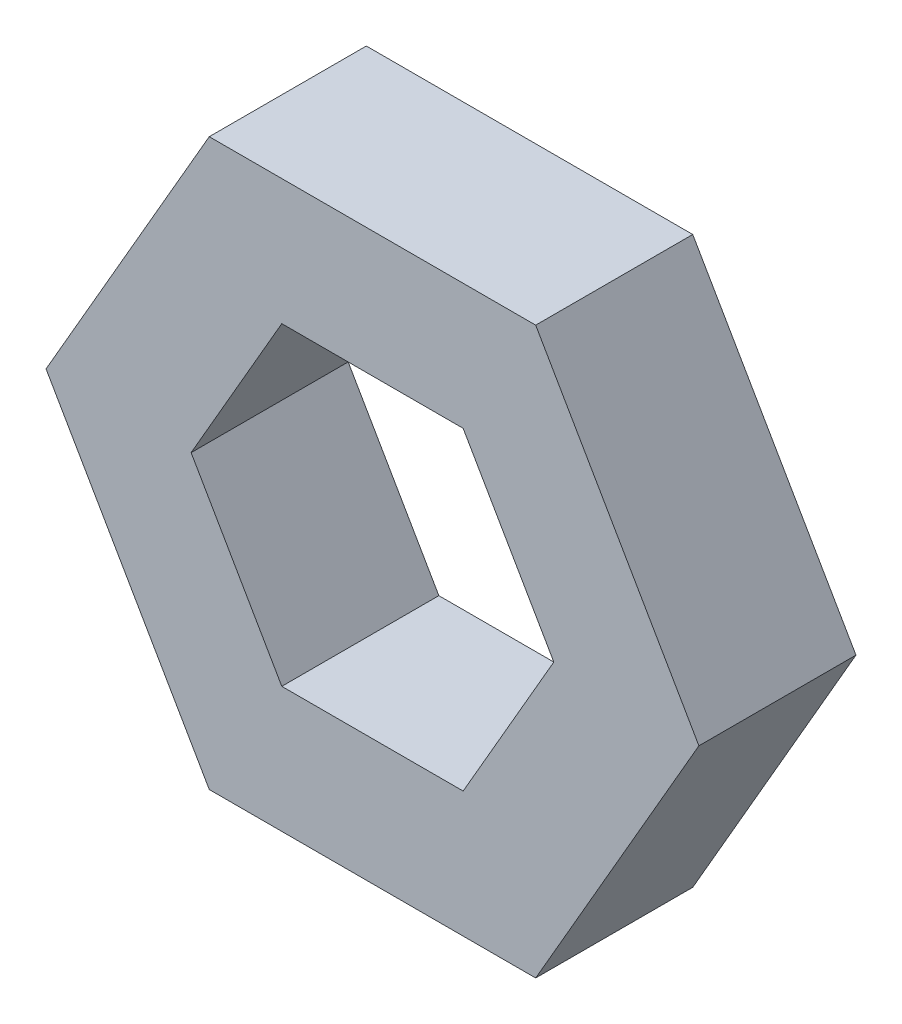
ISO-10303-21;
HEADER;
FILE_DESCRIPTION(('STEP AP214'),'2;1');
FILE_NAME('part.step','',(''),(''),'','','');
FILE_SCHEMA(('AUTOMOTIVE_DESIGN { 1 0 10303 214 1 1 1 1 }'));
ENDSEC;
DATA;
#1=APPLICATION_CONTEXT('core data for automotive mechanical design processes');
#2=APPLICATION_PROTOCOL_DEFINITION('international standard','automotive_design',2000,#1);
#3=PRODUCT_CONTEXT('',#1,'mechanical');
#4=PRODUCT('Part','Part','',(#3));
#5=PRODUCT_RELATED_PRODUCT_CATEGORY('part','',(#4));
#6=PRODUCT_DEFINITION_FORMATION('','',#4);
#7=PRODUCT_DEFINITION_CONTEXT('part definition',#1,'design');
#8=PRODUCT_DEFINITION('design','',#6,#7);
#9=PRODUCT_DEFINITION_SHAPE('','',#8);
#10=(LENGTH_UNIT() NAMED_UNIT(*) SI_UNIT(.MILLI.,.METRE.));
#11=(NAMED_UNIT(*) PLANE_ANGLE_UNIT() SI_UNIT($,.RADIAN.));
#12=(NAMED_UNIT(*) SI_UNIT($,.STERADIAN.) SOLID_ANGLE_UNIT());
#13=UNCERTAINTY_MEASURE_WITH_UNIT(LENGTH_MEASURE(1.E-05),#10,'distance_accuracy_value','');
#14=(GEOMETRIC_REPRESENTATION_CONTEXT(3) GLOBAL_UNCERTAINTY_ASSIGNED_CONTEXT((#13)) GLOBAL_UNIT_ASSIGNED_CONTEXT((#10,
#11,#12)) REPRESENTATION_CONTEXT('',''));
#15=CARTESIAN_POINT('',(0.,0.,0.));
#16=DIRECTION('',(0.,0.,1.));
#17=DIRECTION('',(1.,0.,0.));
#18=AXIS2_PLACEMENT_3D('',#15,#16,#17);
#19=CARTESIAN_POINT('',(0.,0.,3.175));
#20=DIRECTION('',(0.,0.,1.));
#21=DIRECTION('',(1.,0.,0.));
#22=AXIS2_PLACEMENT_3D('',#19,#20,#21);
#23=PLANE('',#22);
#24=DIRECTION('',(0.5,0.866025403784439,0.));
#25=VECTOR('',#24,1.);
#26=CARTESIAN_POINT('',(3.29955678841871,-5.715,3.175));
#27=LINE('',#26,#25);
#28=CARTESIAN_POINT('',(3.29955678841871,-5.715,3.175));
#29=VERTEX_POINT('',#28);
#30=CARTESIAN_POINT('',(6.59911357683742,0.,3.175));
#31=VERTEX_POINT('',#30);
#32=EDGE_CURVE('E175',#29,#31,#27,.T.);
#33=ORIENTED_EDGE('',*,*,#32,.T.);
#34=DIRECTION('',(-0.5,0.866025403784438,0.));
#35=VECTOR('',#34,1.);
#36=CARTESIAN_POINT('',(6.59911357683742,0.,3.175));
#37=LINE('',#36,#35);
#38=CARTESIAN_POINT('',(3.29955678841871,5.715,3.175));
#39=VERTEX_POINT('',#38);
#40=EDGE_CURVE('E178',#31,#39,#37,.T.);
#41=ORIENTED_EDGE('',*,*,#40,.T.);
#42=DIRECTION('',(-1.,0.,0.));
#43=VECTOR('',#42,1.);
#44=CARTESIAN_POINT('',(3.29955678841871,5.715,3.175));
#45=LINE('',#44,#43);
#46=CARTESIAN_POINT('',(-3.29955678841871,5.715,3.175));
#47=VERTEX_POINT('',#46);
#48=EDGE_CURVE('E181',#39,#47,#45,.T.);
#49=ORIENTED_EDGE('',*,*,#48,.T.);
#50=DIRECTION('',(-0.5,-0.866025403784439,0.));
#51=VECTOR('',#50,1.);
#52=CARTESIAN_POINT('',(-3.29955678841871,5.715,3.175));
#53=LINE('',#52,#51);
#54=CARTESIAN_POINT('',(-6.59911357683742,0.,3.175));
#55=VERTEX_POINT('',#54);
#56=EDGE_CURVE('E183',#47,#55,#53,.T.);
#57=ORIENTED_EDGE('',*,*,#56,.T.);
#58=DIRECTION('',(0.5,-0.866025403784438,0.));
#59=VECTOR('',#58,1.);
#60=CARTESIAN_POINT('',(-6.59911357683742,0.,3.175));
#61=LINE('',#60,#59);
#62=CARTESIAN_POINT('',(-3.29955678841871,-5.715,3.175));
#63=VERTEX_POINT('',#62);
#64=EDGE_CURVE('E185',#55,#63,#61,.T.);
#65=ORIENTED_EDGE('',*,*,#64,.T.);
#66=DIRECTION('',(1.,0.,0.));
#67=VECTOR('',#66,1.);
#68=CARTESIAN_POINT('',(-3.29955678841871,-5.715,3.175));
#69=LINE('',#68,#67);
#70=EDGE_CURVE('E187',#63,#29,#69,.T.);
#71=ORIENTED_EDGE('',*,*,#70,.T.);
#72=EDGE_LOOP('',(#33,#41,#49,#57,#65,#71));
#73=FACE_BOUND('',#72,.T.);
#74=DIRECTION('',(-0.500000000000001,0.866025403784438,0.));
#75=VECTOR('',#74,1.);
#76=CARTESIAN_POINT('',(3.66617420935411,0.,3.175));
#77=LINE('',#76,#75);
#78=CARTESIAN_POINT('',(3.66617420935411,0.,3.175));
#79=VERTEX_POINT('',#78);
#80=CARTESIAN_POINT('',(1.83308710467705,3.17499999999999,3.175));
#81=VERTEX_POINT('',#80);
#82=EDGE_CURVE('E132',#79,#81,#77,.T.);
#83=ORIENTED_EDGE('',*,*,#82,.F.);
#84=DIRECTION('',(0.499999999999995,0.866025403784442,0.));
#85=VECTOR('',#84,1.);
#86=CARTESIAN_POINT('',(1.83308710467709,-3.17499999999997,3.175));
#87=LINE('',#86,#85);
#88=CARTESIAN_POINT('',(1.83308710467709,-3.17499999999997,3.175));
#89=VERTEX_POINT('',#88);
#90=EDGE_CURVE('E124',#89,#79,#87,.T.);
#91=ORIENTED_EDGE('',*,*,#90,.F.);
#92=DIRECTION('',(1.,0.,0.));
#93=VECTOR('',#92,1.);
#94=CARTESIAN_POINT('',(-1.83308710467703,-3.17500000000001,3.175));
#95=LINE('',#94,#93);
#96=CARTESIAN_POINT('',(-1.83308710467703,-3.17500000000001,3.175));
#97=VERTEX_POINT('',#96);
#98=EDGE_CURVE('E153',#97,#89,#95,.T.);
#99=ORIENTED_EDGE('',*,*,#98,.F.);
#100=DIRECTION('',(0.500000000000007,-0.866025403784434,0.));
#101=VECTOR('',#100,1.);
#102=CARTESIAN_POINT('',(-3.66617420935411,0.,3.175));
#103=LINE('',#102,#101);
#104=CARTESIAN_POINT('',(-3.66617420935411,0.,3.175));
#105=VERTEX_POINT('',#104);
#106=EDGE_CURVE('E151',#105,#97,#103,.T.);
#107=ORIENTED_EDGE('',*,*,#106,.F.);
#108=DIRECTION('',(-0.499999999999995,-0.866025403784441,0.));
#109=VECTOR('',#108,1.);
#110=CARTESIAN_POINT('',(-1.83308710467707,3.17499999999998,3.175));
#111=LINE('',#110,#109);
#112=CARTESIAN_POINT('',(-1.83308710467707,3.17499999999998,3.175));
#113=VERTEX_POINT('',#112);
#114=EDGE_CURVE('E147',#113,#105,#111,.T.);
#115=ORIENTED_EDGE('',*,*,#114,.F.);
#116=DIRECTION('',(-1.,0.,0.));
#117=VECTOR('',#116,1.);
#118=CARTESIAN_POINT('',(1.83308710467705,3.17499999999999,3.175));
#119=LINE('',#118,#117);
#120=EDGE_CURVE('E145',#81,#113,#119,.T.);
#121=ORIENTED_EDGE('',*,*,#120,.F.);
#122=EDGE_LOOP('',(#83,#91,#99,#107,#115,#121));
#123=FACE_BOUND('',#122,.T.);
#124=ADVANCED_FACE('F35',(#73,#123),#23,.T.);
#125=CARTESIAN_POINT('',(0.,0.,0.));
#126=DIRECTION('',(0.,0.,1.));
#127=DIRECTION('',(1.,0.,0.));
#128=AXIS2_PLACEMENT_3D('',#125,#126,#127);
#129=PLANE('',#128);
#130=DIRECTION('',(0.5,0.866025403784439,0.));
#131=VECTOR('',#130,1.);
#132=CARTESIAN_POINT('',(3.29955678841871,-5.715,0.));
#133=LINE('',#132,#131);
#134=CARTESIAN_POINT('',(3.29955678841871,-5.715,0.));
#135=VERTEX_POINT('',#134);
#136=CARTESIAN_POINT('',(6.59911357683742,0.,0.));
#137=VERTEX_POINT('',#136);
#138=EDGE_CURVE('E140',#135,#137,#133,.T.);
#139=ORIENTED_EDGE('',*,*,#138,.F.);
#140=DIRECTION('',(1.,0.,0.));
#141=VECTOR('',#140,1.);
#142=CARTESIAN_POINT('',(-3.29955678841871,-5.715,0.));
#143=LINE('',#142,#141);
#144=CARTESIAN_POINT('',(-3.29955678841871,-5.715,0.));
#145=VERTEX_POINT('',#144);
#146=EDGE_CURVE('E179',#145,#135,#143,.T.);
#147=ORIENTED_EDGE('',*,*,#146,.F.);
#148=DIRECTION('',(0.5,-0.866025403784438,0.));
#149=VECTOR('',#148,1.);
#150=CARTESIAN_POINT('',(-6.59911357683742,0.,0.));
#151=LINE('',#150,#149);
#152=CARTESIAN_POINT('',(-6.59911357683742,0.,0.));
#153=VERTEX_POINT('',#152);
#154=EDGE_CURVE('E198',#153,#145,#151,.T.);
#155=ORIENTED_EDGE('',*,*,#154,.F.);
#156=DIRECTION('',(-0.5,-0.866025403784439,0.));
#157=VECTOR('',#156,1.);
#158=CARTESIAN_POINT('',(-3.29955678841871,5.715,0.));
#159=LINE('',#158,#157);
#160=CARTESIAN_POINT('',(-3.29955678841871,5.715,0.));
#161=VERTEX_POINT('',#160);
#162=EDGE_CURVE('E196',#161,#153,#159,.T.);
#163=ORIENTED_EDGE('',*,*,#162,.F.);
#164=DIRECTION('',(-1.,0.,0.));
#165=VECTOR('',#164,1.);
#166=CARTESIAN_POINT('',(3.29955678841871,5.715,0.));
#167=LINE('',#166,#165);
#168=CARTESIAN_POINT('',(3.29955678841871,5.715,0.));
#169=VERTEX_POINT('',#168);
#170=EDGE_CURVE('E194',#169,#161,#167,.T.);
#171=ORIENTED_EDGE('',*,*,#170,.F.);
#172=DIRECTION('',(-0.5,0.866025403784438,0.));
#173=VECTOR('',#172,1.);
#174=CARTESIAN_POINT('',(6.59911357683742,0.,0.));
#175=LINE('',#174,#173);
#176=EDGE_CURVE('E192',#137,#169,#175,.T.);
#177=ORIENTED_EDGE('',*,*,#176,.F.);
#178=EDGE_LOOP('',(#139,#147,#155,#163,#171,#177));
#179=FACE_BOUND('',#178,.T.);
#180=DIRECTION('',(0.499999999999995,0.866025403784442,0.));
#181=VECTOR('',#180,1.);
#182=CARTESIAN_POINT('',(1.83308710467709,-3.17499999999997,0.));
#183=LINE('',#182,#181);
#184=CARTESIAN_POINT('',(1.83308710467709,-3.17499999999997,0.));
#185=VERTEX_POINT('',#184);
#186=CARTESIAN_POINT('',(3.66617420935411,0.,0.));
#187=VERTEX_POINT('',#186);
#188=EDGE_CURVE('E58',#185,#187,#183,.T.);
#189=ORIENTED_EDGE('',*,*,#188,.T.);
#190=DIRECTION('',(-0.500000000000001,0.866025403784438,0.));
#191=VECTOR('',#190,1.);
#192=CARTESIAN_POINT('',(3.66617420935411,0.,0.));
#193=LINE('',#192,#191);
#194=CARTESIAN_POINT('',(1.83308710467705,3.17499999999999,0.));
#195=VERTEX_POINT('',#194);
#196=EDGE_CURVE('E139',#187,#195,#193,.T.);
#197=ORIENTED_EDGE('',*,*,#196,.T.);
#198=DIRECTION('',(-1.,0.,0.));
#199=VECTOR('',#198,1.);
#200=CARTESIAN_POINT('',(1.83308710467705,3.17499999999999,0.));
#201=LINE('',#200,#199);
#202=CARTESIAN_POINT('',(-1.83308710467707,3.17499999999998,0.));
#203=VERTEX_POINT('',#202);
#204=EDGE_CURVE('E157',#195,#203,#201,.T.);
#205=ORIENTED_EDGE('',*,*,#204,.T.);
#206=DIRECTION('',(-0.499999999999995,-0.866025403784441,0.));
#207=VECTOR('',#206,1.);
#208=CARTESIAN_POINT('',(-1.83308710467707,3.17499999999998,0.));
#209=LINE('',#208,#207);
#210=CARTESIAN_POINT('',(-3.66617420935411,0.,0.));
#211=VERTEX_POINT('',#210);
#212=EDGE_CURVE('E160',#203,#211,#209,.T.);
#213=ORIENTED_EDGE('',*,*,#212,.T.);
#214=DIRECTION('',(0.500000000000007,-0.866025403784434,0.));
#215=VECTOR('',#214,1.);
#216=CARTESIAN_POINT('',(-3.66617420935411,0.,0.));
#217=LINE('',#216,#215);
#218=CARTESIAN_POINT('',(-1.83308710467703,-3.17500000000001,0.));
#219=VERTEX_POINT('',#218);
#220=EDGE_CURVE('E163',#211,#219,#217,.T.);
#221=ORIENTED_EDGE('',*,*,#220,.T.);
#222=DIRECTION('',(1.,0.,0.));
#223=VECTOR('',#222,1.);
#224=CARTESIAN_POINT('',(-1.83308710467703,-3.17500000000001,0.));
#225=LINE('',#224,#223);
#226=EDGE_CURVE('E133',#219,#185,#225,.T.);
#227=ORIENTED_EDGE('',*,*,#226,.T.);
#228=EDGE_LOOP('',(#189,#197,#205,#213,#221,#227));
#229=FACE_BOUND('',#228,.T.);
#230=ADVANCED_FACE('F222',(#179,#229),#129,.F.);
#231=CARTESIAN_POINT('',(3.29955678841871,-5.715,3.175));
#232=DIRECTION('',(-0.866025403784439,0.5,0.));
#233=DIRECTION('',(-0.5,-0.866025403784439,0.));
#234=AXIS2_PLACEMENT_3D('',#231,#232,#233);
#235=PLANE('',#234);
#236=ORIENTED_EDGE('',*,*,#138,.T.);
#237=DIRECTION('',(0.,0.,-1.));
#238=VECTOR('',#237,1.);
#239=CARTESIAN_POINT('',(6.59911357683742,0.,3.175));
#240=LINE('',#239,#238);
#241=EDGE_CURVE('E11',#31,#137,#240,.T.);
#242=ORIENTED_EDGE('',*,*,#241,.F.);
#243=ORIENTED_EDGE('',*,*,#32,.F.);
#244=DIRECTION('',(0.,0.,-1.));
#245=VECTOR('',#244,1.);
#246=CARTESIAN_POINT('',(3.29955678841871,-5.715,3.175));
#247=LINE('',#246,#245);
#248=EDGE_CURVE('E189',#29,#135,#247,.T.);
#249=ORIENTED_EDGE('',*,*,#248,.T.);
#250=EDGE_LOOP('',(#236,#242,#243,#249));
#251=FACE_BOUND('',#250,.T.);
#252=ADVANCED_FACE('F37',(#251),#235,.F.);
#253=CARTESIAN_POINT('',(6.59911357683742,0.,3.175));
#254=DIRECTION('',(-0.866025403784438,-0.5,0.));
#255=DIRECTION('',(0.5,-0.866025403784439,0.));
#256=AXIS2_PLACEMENT_3D('',#253,#254,#255);
#257=PLANE('',#256);
#258=ORIENTED_EDGE('',*,*,#176,.T.);
#259=DIRECTION('',(0.,0.,-1.));
#260=VECTOR('',#259,1.);
#261=CARTESIAN_POINT('',(3.29955678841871,5.715,3.175));
#262=LINE('',#261,#260);
#263=EDGE_CURVE('E43',#39,#169,#262,.T.);
#264=ORIENTED_EDGE('',*,*,#263,.F.);
#265=ORIENTED_EDGE('',*,*,#40,.F.);
#266=ORIENTED_EDGE('',*,*,#241,.T.);
#267=EDGE_LOOP('',(#258,#264,#265,#266));
#268=FACE_BOUND('',#267,.T.);
#269=ADVANCED_FACE('F239',(#268),#257,.F.);
#270=CARTESIAN_POINT('',(3.29955678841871,5.715,3.175));
#271=DIRECTION('',(0.,-1.,0.));
#272=DIRECTION('',(0.,0.,-1.));
#273=AXIS2_PLACEMENT_3D('',#270,#271,#272);
#274=PLANE('',#273);
#275=ORIENTED_EDGE('',*,*,#170,.T.);
#276=DIRECTION('',(0.,0.,-1.));
#277=VECTOR('',#276,1.);
#278=CARTESIAN_POINT('',(-3.29955678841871,5.715,3.175));
#279=LINE('',#278,#277);
#280=EDGE_CURVE('E209',#47,#161,#279,.T.);
#281=ORIENTED_EDGE('',*,*,#280,.F.);
#282=ORIENTED_EDGE('',*,*,#48,.F.);
#283=ORIENTED_EDGE('',*,*,#263,.T.);
#284=EDGE_LOOP('',(#275,#281,#282,#283));
#285=FACE_BOUND('',#284,.T.);
#286=ADVANCED_FACE('F216',(#285),#274,.F.);
#287=CARTESIAN_POINT('',(-3.29955678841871,5.715,3.175));
#288=DIRECTION('',(0.866025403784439,-0.5,0.));
#289=DIRECTION('',(0.5,0.866025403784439,0.));
#290=AXIS2_PLACEMENT_3D('',#287,#288,#289);
#291=PLANE('',#290);
#292=ORIENTED_EDGE('',*,*,#162,.T.);
#293=DIRECTION('',(0.,0.,-1.));
#294=VECTOR('',#293,1.);
#295=CARTESIAN_POINT('',(-6.59911357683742,0.,3.175));
#296=LINE('',#295,#294);
#297=EDGE_CURVE('E206',#55,#153,#296,.T.);
#298=ORIENTED_EDGE('',*,*,#297,.F.);
#299=ORIENTED_EDGE('',*,*,#56,.F.);
#300=ORIENTED_EDGE('',*,*,#280,.T.);
#301=EDGE_LOOP('',(#292,#298,#299,#300));
#302=FACE_BOUND('',#301,.T.);
#303=ADVANCED_FACE('F228',(#302),#291,.F.);
#304=CARTESIAN_POINT('',(-6.59911357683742,0.,3.175));
#305=DIRECTION('',(0.866025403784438,0.5,0.));
#306=DIRECTION('',(-0.5,0.866025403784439,0.));
#307=AXIS2_PLACEMENT_3D('',#304,#305,#306);
#308=PLANE('',#307);
#309=ORIENTED_EDGE('',*,*,#154,.T.);
#310=DIRECTION('',(0.,0.,-1.));
#311=VECTOR('',#310,1.);
#312=CARTESIAN_POINT('',(-3.29955678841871,-5.715,3.175));
#313=LINE('',#312,#311);
#314=EDGE_CURVE('E203',#63,#145,#313,.T.);
#315=ORIENTED_EDGE('',*,*,#314,.F.);
#316=ORIENTED_EDGE('',*,*,#64,.F.);
#317=ORIENTED_EDGE('',*,*,#297,.T.);
#318=EDGE_LOOP('',(#309,#315,#316,#317));
#319=FACE_BOUND('',#318,.T.);
#320=ADVANCED_FACE('F232',(#319),#308,.F.);
#321=CARTESIAN_POINT('',(-3.29955678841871,-5.715,3.175));
#322=DIRECTION('',(0.,1.,0.));
#323=DIRECTION('',(-1.,0.,0.));
#324=AXIS2_PLACEMENT_3D('',#321,#322,#323);
#325=PLANE('',#324);
#326=ORIENTED_EDGE('',*,*,#146,.T.);
#327=ORIENTED_EDGE('',*,*,#248,.F.);
#328=ORIENTED_EDGE('',*,*,#70,.F.);
#329=ORIENTED_EDGE('',*,*,#314,.T.);
#330=EDGE_LOOP('',(#326,#327,#328,#329));
#331=FACE_BOUND('',#330,.T.);
#332=ADVANCED_FACE('F242',(#331),#325,.F.);
#333=CARTESIAN_POINT('',(1.83308710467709,-3.17499999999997,3.175));
#334=DIRECTION('',(-0.866025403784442,0.499999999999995,0.));
#335=DIRECTION('',(-0.499999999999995,-0.866025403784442,0.));
#336=AXIS2_PLACEMENT_3D('',#333,#334,#335);
#337=PLANE('',#336);
#338=ORIENTED_EDGE('',*,*,#188,.F.);
#339=DIRECTION('',(0.,0.,-1.));
#340=VECTOR('',#339,1.);
#341=CARTESIAN_POINT('',(1.83308710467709,-3.17499999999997,3.175));
#342=LINE('',#341,#340);
#343=EDGE_CURVE('E128',#89,#185,#342,.T.);
#344=ORIENTED_EDGE('',*,*,#343,.F.);
#345=ORIENTED_EDGE('',*,*,#90,.T.);
#346=DIRECTION('',(0.,0.,-1.));
#347=VECTOR('',#346,1.);
#348=CARTESIAN_POINT('',(3.66617420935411,0.,3.175));
#349=LINE('',#348,#347);
#350=EDGE_CURVE('E127',#79,#187,#349,.T.);
#351=ORIENTED_EDGE('',*,*,#350,.T.);
#352=EDGE_LOOP('',(#338,#344,#345,#351));
#353=FACE_BOUND('',#352,.T.);
#354=ADVANCED_FACE('F126',(#353),#337,.T.);
#355=CARTESIAN_POINT('',(3.66617420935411,0.,3.175));
#356=DIRECTION('',(-0.866025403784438,-0.500000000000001,0.));
#357=DIRECTION('',(0.500000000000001,-0.866025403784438,0.));
#358=AXIS2_PLACEMENT_3D('',#355,#356,#357);
#359=PLANE('',#358);
#360=ORIENTED_EDGE('',*,*,#196,.F.);
#361=ORIENTED_EDGE('',*,*,#350,.F.);
#362=ORIENTED_EDGE('',*,*,#82,.T.);
#363=DIRECTION('',(0.,0.,-1.));
#364=VECTOR('',#363,1.);
#365=CARTESIAN_POINT('',(1.83308710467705,3.17499999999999,3.175));
#366=LINE('',#365,#364);
#367=EDGE_CURVE('E141',#81,#195,#366,.T.);
#368=ORIENTED_EDGE('',*,*,#367,.T.);
#369=EDGE_LOOP('',(#360,#361,#362,#368));
#370=FACE_BOUND('',#369,.T.);
#371=ADVANCED_FACE('F136',(#370),#359,.T.);
#372=CARTESIAN_POINT('',(1.83308710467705,3.17499999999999,3.175));
#373=DIRECTION('',(0.,-1.,0.));
#374=DIRECTION('',(1.,0.,0.));
#375=AXIS2_PLACEMENT_3D('',#372,#373,#374);
#376=PLANE('',#375);
#377=ORIENTED_EDGE('',*,*,#204,.F.);
#378=ORIENTED_EDGE('',*,*,#367,.F.);
#379=ORIENTED_EDGE('',*,*,#120,.T.);
#380=DIRECTION('',(0.,0.,-1.));
#381=VECTOR('',#380,1.);
#382=CARTESIAN_POINT('',(-1.83308710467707,3.17499999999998,3.175));
#383=LINE('',#382,#381);
#384=EDGE_CURVE('E172',#113,#203,#383,.T.);
#385=ORIENTED_EDGE('',*,*,#384,.T.);
#386=EDGE_LOOP('',(#377,#378,#379,#385));
#387=FACE_BOUND('',#386,.T.);
#388=ADVANCED_FACE('F260',(#387),#376,.T.);
#389=CARTESIAN_POINT('',(-1.83308710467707,3.17499999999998,3.175));
#390=DIRECTION('',(0.866025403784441,-0.499999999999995,0.));
#391=DIRECTION('',(0.499999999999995,0.866025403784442,0.));
#392=AXIS2_PLACEMENT_3D('',#389,#390,#391);
#393=PLANE('',#392);
#394=ORIENTED_EDGE('',*,*,#212,.F.);
#395=ORIENTED_EDGE('',*,*,#384,.F.);
#396=ORIENTED_EDGE('',*,*,#114,.T.);
#397=DIRECTION('',(0.,0.,-1.));
#398=VECTOR('',#397,1.);
#399=CARTESIAN_POINT('',(-3.66617420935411,0.,3.175));
#400=LINE('',#399,#398);
#401=EDGE_CURVE('E170',#105,#211,#400,.T.);
#402=ORIENTED_EDGE('',*,*,#401,.T.);
#403=EDGE_LOOP('',(#394,#395,#396,#402));
#404=FACE_BOUND('',#403,.T.);
#405=ADVANCED_FACE('F263',(#404),#393,.T.);
#406=CARTESIAN_POINT('',(-3.66617420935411,0.,3.175));
#407=DIRECTION('',(0.866025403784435,0.500000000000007,0.));
#408=DIRECTION('',(-0.500000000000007,0.866025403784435,0.));
#409=AXIS2_PLACEMENT_3D('',#406,#407,#408);
#410=PLANE('',#409);
#411=ORIENTED_EDGE('',*,*,#220,.F.);
#412=ORIENTED_EDGE('',*,*,#401,.F.);
#413=ORIENTED_EDGE('',*,*,#106,.T.);
#414=DIRECTION('',(0.,0.,-1.));
#415=VECTOR('',#414,1.);
#416=CARTESIAN_POINT('',(-1.83308710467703,-3.17500000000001,3.175));
#417=LINE('',#416,#415);
#418=EDGE_CURVE('E50',#97,#219,#417,.T.);
#419=ORIENTED_EDGE('',*,*,#418,.T.);
#420=EDGE_LOOP('',(#411,#412,#413,#419));
#421=FACE_BOUND('',#420,.T.);
#422=ADVANCED_FACE('F267',(#421),#410,.T.);
#423=CARTESIAN_POINT('',(-1.83308710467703,-3.17500000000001,3.175));
#424=DIRECTION('',(0.,1.,0.));
#425=DIRECTION('',(-1.,0.,0.));
#426=AXIS2_PLACEMENT_3D('',#423,#424,#425);
#427=PLANE('',#426);
#428=ORIENTED_EDGE('',*,*,#226,.F.);
#429=ORIENTED_EDGE('',*,*,#418,.F.);
#430=ORIENTED_EDGE('',*,*,#98,.T.);
#431=ORIENTED_EDGE('',*,*,#343,.T.);
#432=EDGE_LOOP('',(#428,#429,#430,#431));
#433=FACE_BOUND('',#432,.T.);
#434=ADVANCED_FACE('F271',(#433),#427,.T.);
#435=CLOSED_SHELL('',(#124,#230,#252,#269,#286,#303,#320,#332,#354,#371,#388,#405,#422,#434));
#436=MANIFOLD_SOLID_BREP('B2',#435);
#437=ADVANCED_BREP_SHAPE_REPRESENTATION('',(#18,#436),#14);
#438=SHAPE_DEFINITION_REPRESENTATION(#9,#437);
ENDSEC;
END-ISO-10303-21;
